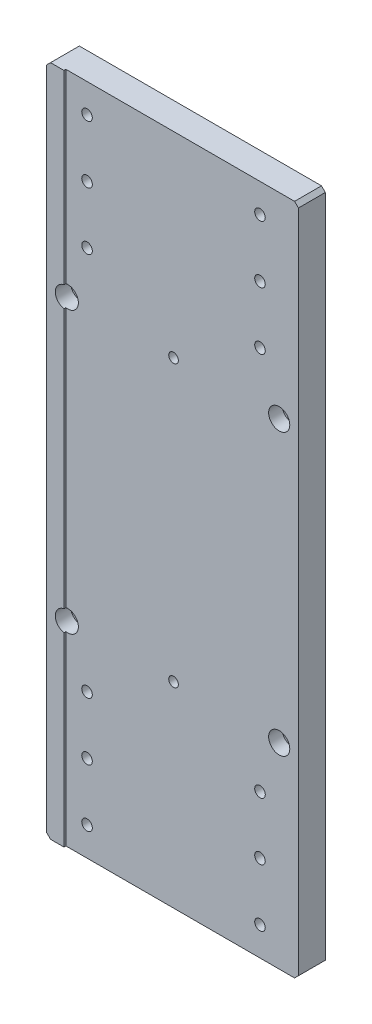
from build123d import *

# Parameters (mm, degrees)
SKETCH_1_W                   = 130
SKETCH_1_H                   = 350
EXTRUDE_1_DEPTH              = 7.5
SKETCH_2_W                   = 121
SKETCH_2_H                   = 350
CUT_EXTRUDE_1_DEPTH          = 1
HOLE_WIZARD_M6_1_D           = 6.6
HOLE_WIZARD_M6_1_CBORE_D     = 11
HOLE_WIZARD_M6_1_CBORE_DEPTH = 8
HOLE_WIZARD_M5_1_D           = 5.5
HOLE_WIZARD_M5_1_CBORE_D     = 9.5
HOLE_WIZARD_M5_1_CBORE_DEPTH = 7
PATTERN_LINEAR_1_COUNT       = 2
PATTERN_LINEAR_1_PITCH       = 260
F_5_0MM_1_D                  = 5
CHAMFER_1_SIZE               = 2


with BuildPart() as part:
    # Sketch 1 → Extrude 1 (new, symmetric)
    with BuildSketch(Plane.XY):
        Rectangle(SKETCH_1_W, SKETCH_1_H)
    extrude(amount=EXTRUDE_1_DEPTH, both=True)

    # Sketch 2 → Cut-Extrude 1 (cut)
    with BuildSketch(Plane.XY.offset(7.5)):
        with Locations((4.5, 0)):
            Rectangle(SKETCH_2_W, SKETCH_2_H)
    extrude(amount=-CUT_EXTRUDE_1_DEPTH, mode=Mode.SUBTRACT)

    # Hole Wizard M6 _ _ _ _ _1 (through all)
    with Locations(Plane.XY.offset(7.5)):
        with Locations((-55, 73), (55, 73), (-55, -73), (55, -73)):
            CounterBoreHole(HOLE_WIZARD_M6_1_D / 2, HOLE_WIZARD_M6_1_CBORE_D / 2, HOLE_WIZARD_M6_1_CBORE_DEPTH)

    # Hole Wizard M5 _ _ _ _ _1 (through all)
    with Locations(Plane(origin=(0, 0, -7.5), x_dir=(-1, 0, 0), z_dir=(0, 0, -1))):
        with Locations((-45, 160), (45, 160), (-45, 130), (45, 130), (45, 100), (-45, 100)):
            hole_wizard_m5_1 = CounterBoreHole(HOLE_WIZARD_M5_1_D / 2, HOLE_WIZARD_M5_1_CBORE_D / 2, HOLE_WIZARD_M5_1_CBORE_DEPTH)

    # Pattern Linear 1: Hole Wizard M5 _ _ _ _ _1 ×2
    with Locations(*[(0, -i * PATTERN_LINEAR_1_PITCH, 0) for i in range(1, PATTERN_LINEAR_1_COUNT)]):
        add(hole_wizard_m5_1, mode=Mode.SUBTRACT)

    # 5.0mm _ _1 (through all)
    with Locations(Plane.XY.offset(6.5)):
        with Locations((0, -73), (0, 73)):
            Hole(F_5_0MM_1_D / 2)

    # Chamfer 1
    chamfer_1_edges = [part.edges().sort_by_distance(p)[0] for p in [
        (65, -175, -0.5),
        (65, 175, -0.5),
        (-65, -175, 0),
        (-65, 175, 0),
    ]]
    chamfer(chamfer_1_edges, length=CHAMFER_1_SIZE)


solid = part.part
